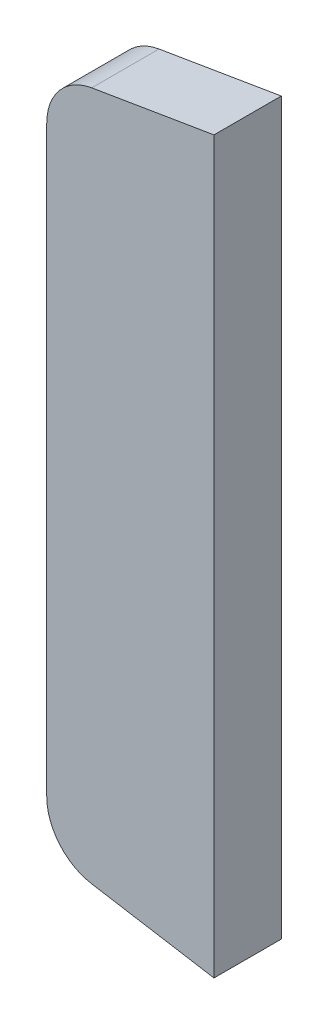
from build123d import *

# Parameters (mm, degrees)
BOSS_EXTRUDE1_DEPTH = 5


with BuildPart() as part:
    # Sketch1 → Boss-Extrude1 (new, symmetric)
    with BuildSketch(Plane.XY):
        with BuildLine():
            Line((0, 54.24963556), (0, -54.24963556))
            Line((0, -54.24963556), (-18.162289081, -51.222366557))
            ThreePointArc((-18.162289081, -51.222366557), (-22.951194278, -48.502193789), (-24.847003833, -43.331230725))
            Line((-24.847003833, -43.331230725), (-24.847003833, 43.331230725))
            ThreePointArc((-24.847003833, 43.331230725), (-22.951194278, 48.502193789), (-18.162289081, 51.222366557))
            Line((-18.162289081, 51.222366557), (0, 54.24963556))
        make_face()
    extrude(amount=BOSS_EXTRUDE1_DEPTH, both=True)


solid = part.part
